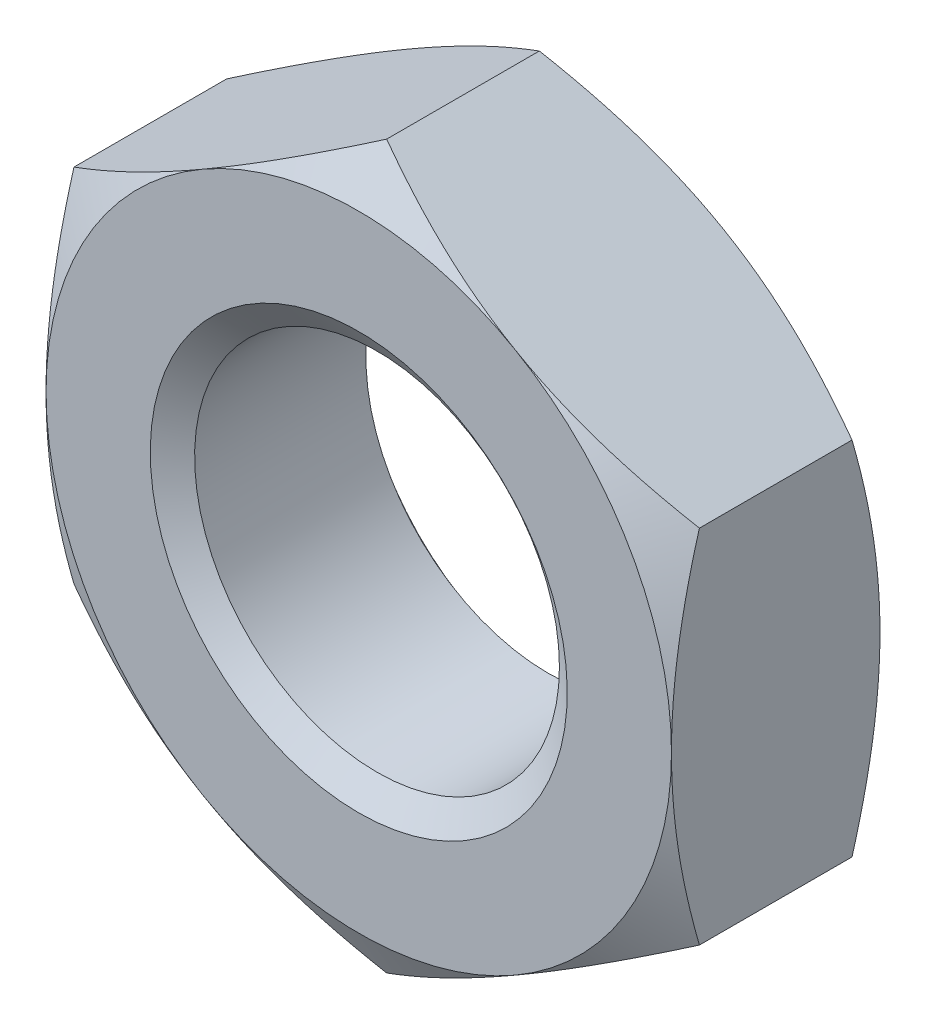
ISO-10303-21;
HEADER;
FILE_DESCRIPTION(('STEP AP214'),'2;1');
FILE_NAME('part.step','',(''),(''),'','','');
FILE_SCHEMA(('AUTOMOTIVE_DESIGN { 1 0 10303 214 1 1 1 1 }'));
ENDSEC;
DATA;
#1=APPLICATION_CONTEXT('core data for automotive mechanical design processes');
#2=APPLICATION_PROTOCOL_DEFINITION('international standard','automotive_design',2000,#1);
#3=PRODUCT_CONTEXT('',#1,'mechanical');
#4=PRODUCT('Part','Part','',(#3));
#5=PRODUCT_RELATED_PRODUCT_CATEGORY('part','',(#4));
#6=PRODUCT_DEFINITION_FORMATION('','',#4);
#7=PRODUCT_DEFINITION_CONTEXT('part definition',#1,'design');
#8=PRODUCT_DEFINITION('design','',#6,#7);
#9=PRODUCT_DEFINITION_SHAPE('','',#8);
#10=(LENGTH_UNIT() NAMED_UNIT(*) SI_UNIT(.MILLI.,.METRE.));
#11=(NAMED_UNIT(*) PLANE_ANGLE_UNIT() SI_UNIT($,.RADIAN.));
#12=(NAMED_UNIT(*) SI_UNIT($,.STERADIAN.) SOLID_ANGLE_UNIT());
#13=UNCERTAINTY_MEASURE_WITH_UNIT(LENGTH_MEASURE(1.E-05),#10,'distance_accuracy_value','');
#14=(GEOMETRIC_REPRESENTATION_CONTEXT(3) GLOBAL_UNCERTAINTY_ASSIGNED_CONTEXT((#13)) GLOBAL_UNIT_ASSIGNED_CONTEXT((#10,
#11,#12)) REPRESENTATION_CONTEXT('',''));
#15=CARTESIAN_POINT('',(0.,0.,0.));
#16=DIRECTION('',(0.,0.,1.));
#17=DIRECTION('',(1.,0.,0.));
#18=AXIS2_PLACEMENT_3D('',#15,#16,#17);
#19=CARTESIAN_POINT('',(-1.83186799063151E-12,13.8564064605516,-7.99999999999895));
#20=DIRECTION('',(0.,0.,-1.));
#21=DIRECTION('',(0.,1.,0.));
#22=AXIS2_PLACEMENT_3D('',#19,#20,#21);
#23=PLANE('',#22);
#24=CARTESIAN_POINT('',(-1.69011516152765E-12,4.88540473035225E-13,-7.99999999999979));
#25=DIRECTION('',(0.,0.,1.));
#26=DIRECTION('',(0.,-1.,0.));
#27=AXIS2_PLACEMENT_3D('',#24,#25,#26);
#28=CIRCLE('',#27,8.00000000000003);
#29=CARTESIAN_POINT('',(-1.69011516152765E-12,-7.99999999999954,-7.99999999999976));
#30=VERTEX_POINT('',#29);
#31=EDGE_CURVE('E18',#30,#30,#28,.T.);
#32=ORIENTED_EDGE('',*,*,#31,.T.);
#33=EDGE_LOOP('',(#32));
#34=FACE_BOUND('',#33,.T.);
#35=CARTESIAN_POINT('',(0.,0.,-8.00000000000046));
#36=DIRECTION('',(0.,0.,1.));
#37=DIRECTION('',(0.,-1.,0.));
#38=AXIS2_PLACEMENT_3D('',#35,#36,#37);
#39=CIRCLE('',#38,11.9999999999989);
#40=CARTESIAN_POINT('',(5.99999999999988,-10.3923048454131,-8.00000000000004));
#41=VERTEX_POINT('',#40);
#42=CARTESIAN_POINT('',(11.9999999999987,0.,-8.00000000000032));
#43=VERTEX_POINT('',#42);
#44=EDGE_CURVE('E101',#41,#43,#39,.T.);
#45=ORIENTED_EDGE('',*,*,#44,.F.);
#46=CARTESIAN_POINT('',(0.,0.,-7.9999999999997));
#47=DIRECTION('',(0.,0.,1.));
#48=DIRECTION('',(0.,-1.,0.));
#49=AXIS2_PLACEMENT_3D('',#46,#47,#48);
#50=CIRCLE('',#49,12.0000000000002);
#51=CARTESIAN_POINT('',(-6.00000000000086,-10.3923048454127,-7.99999999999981));
#52=VERTEX_POINT('',#51);
#53=EDGE_CURVE('E110',#52,#41,#50,.T.);
#54=ORIENTED_EDGE('',*,*,#53,.F.);
#55=CARTESIAN_POINT('',(0.,0.,-7.99999999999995));
#56=DIRECTION('',(0.,0.,1.));
#57=DIRECTION('',(0.,-1.,0.));
#58=AXIS2_PLACEMENT_3D('',#55,#56,#57);
#59=CIRCLE('',#58,11.9999999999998);
#60=CARTESIAN_POINT('',(-12.0000000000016,0.,-7.99999999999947));
#61=VERTEX_POINT('',#60);
#62=EDGE_CURVE('E418',#61,#52,#59,.T.);
#63=ORIENTED_EDGE('',*,*,#62,.F.);
#64=CARTESIAN_POINT('',(0.,0.,-7.99999999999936));
#65=DIRECTION('',(0.,0.,1.));
#66=DIRECTION('',(0.,-1.,0.));
#67=AXIS2_PLACEMENT_3D('',#64,#65,#66);
#68=CIRCLE('',#67,12.0000000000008);
#69=CARTESIAN_POINT('',(-6.00000000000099,10.3923048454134,-7.99999999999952));
#70=VERTEX_POINT('',#69);
#71=EDGE_CURVE('E166',#70,#61,#68,.T.);
#72=ORIENTED_EDGE('',*,*,#71,.F.);
#73=CARTESIAN_POINT('',(0.,0.,-7.99999999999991));
#74=DIRECTION('',(0.,0.,1.));
#75=DIRECTION('',(0.,-1.,0.));
#76=AXIS2_PLACEMENT_3D('',#73,#74,#75);
#77=CIRCLE('',#76,11.9999999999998);
#78=CARTESIAN_POINT('',(5.99999999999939,10.3923048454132,-8.00000000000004));
#79=VERTEX_POINT('',#78);
#80=EDGE_CURVE('E116',#79,#70,#77,.T.);
#81=ORIENTED_EDGE('',*,*,#80,.F.);
#82=CARTESIAN_POINT('',(0.,0.,-8.00000000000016));
#83=DIRECTION('',(0.,0.,1.));
#84=DIRECTION('',(0.,-1.,0.));
#85=AXIS2_PLACEMENT_3D('',#82,#83,#84);
#86=CIRCLE('',#85,11.9999999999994);
#87=EDGE_CURVE('E111',#43,#79,#86,.T.);
#88=ORIENTED_EDGE('',*,*,#87,.F.);
#89=EDGE_LOOP('',(#45,#54,#63,#72,#81,#88));
#90=FACE_BOUND('',#89,.T.);
#91=ADVANCED_FACE('F15',(#34,#90),#23,.T.);
#92=CARTESIAN_POINT('',(-1.65145674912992E-12,4.44089209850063E-13,-25.037505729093));
#93=DIRECTION('',(0.,0.,1.));
#94=DIRECTION('',(0.,-1.,0.));
#95=AXIS2_PLACEMENT_3D('',#92,#93,#94);
#96=CYLINDRICAL_SURFACE('',#95,8.00000000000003);
#97=ORIENTED_EDGE('',*,*,#31,.F.);
#98=EDGE_LOOP('',(#97));
#99=FACE_BOUND('',#98,.T.);
#100=CARTESIAN_POINT('',(-9.85322934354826E-13,1.38777878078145E-12,-7.97460000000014));
#101=DIRECTION('',(0.,0.,-1.));
#102=DIRECTION('',(-1.,0.,0.));
#103=AXIS2_PLACEMENT_3D('',#100,#101,#102);
#104=CIRCLE('',#103,8.00000000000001);
#105=CARTESIAN_POINT('',(-8.00000000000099,1.37670430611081E-12,-7.97460000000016));
#106=VERTEX_POINT('',#105);
#107=EDGE_CURVE('E165',#106,#106,#104,.F.);
#108=ORIENTED_EDGE('',*,*,#107,.T.);
#109=EDGE_LOOP('',(#108));
#110=FACE_BOUND('',#109,.T.);
#111=ADVANCED_FACE('F157',(#99,#110),#96,.F.);
#112=CARTESIAN_POINT('',(0.,0.,-6.92177244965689));
#113=DIRECTION('',(0.,0.,1.));
#114=DIRECTION('',(0.,-1.,0.));
#115=AXIS2_PLACEMENT_3D('',#112,#113,#114);
#116=CONICAL_SURFACE('',#115,13.8675448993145,1.0471975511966);
#117=CARTESIAN_POINT('',(11.9999999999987,6.92820323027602,-6.92820323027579));
#118=CARTESIAN_POINT('',(11.9999999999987,6.36399154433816,-7.091059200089));
#119=CARTESIAN_POINT('',(11.9999999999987,5.79563880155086,-7.24024473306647));
#120=CARTESIAN_POINT('',(11.9999999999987,4.93861967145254,-7.43772504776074));
#121=CARTESIAN_POINT('',(11.9999999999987,4.65290698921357,-7.49904993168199));
#122=CARTESIAN_POINT('',(11.9999999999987,4.07960857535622,-7.61222368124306));
#123=CARTESIAN_POINT('',(11.9999999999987,3.79202295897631,-7.6640731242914));
#124=CARTESIAN_POINT('',(11.9999999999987,3.21482083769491,-7.75746975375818));
#125=CARTESIAN_POINT('',(11.9999999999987,2.92520230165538,-7.79900443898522));
#126=CARTESIAN_POINT('',(11.9999999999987,2.34458000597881,-7.87089898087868));
#127=CARTESIAN_POINT('',(11.9999999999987,2.05357628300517,-7.90125913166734));
#128=CARTESIAN_POINT('',(11.9999999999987,1.46910561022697,-7.95027570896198));
#129=CARTESIAN_POINT('',(11.9999999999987,1.17563362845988,-7.96887261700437));
#130=CARTESIAN_POINT('',(11.9999999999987,0.588112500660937,-7.99376065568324));
#131=CARTESIAN_POINT('',(11.9999999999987,0.294063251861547,-8.00004934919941));
#132=CARTESIAN_POINT('',(11.9999999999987,0.,-8.0000000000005));
#133=B_SPLINE_CURVE_WITH_KNOTS('',3,(#117,#118,#119,#120,#121,#122,#123,#124,#125,#126,#127,
#128,#129,#130,#131,#132),.UNSPECIFIED.,.F.,.F.,(4,2,2,2,2,2,2,4),(0.,1.76168798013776,
2.63822760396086,3.51471379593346,4.39225713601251,5.2697773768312,6.15170281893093,
7.0338028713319),.UNSPECIFIED.);
#134=CARTESIAN_POINT('',(11.9999999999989,6.9282032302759,-6.92820323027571));
#135=VERTEX_POINT('',#134);
#136=EDGE_CURVE('E125',#135,#43,#133,.T.);
#137=ORIENTED_EDGE('',*,*,#136,.T.);
#138=ORIENTED_EDGE('',*,*,#87,.T.);
#139=CARTESIAN_POINT('',(11.9999999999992,6.92820323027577,-6.92820323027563));
#140=CARTESIAN_POINT('',(11.511378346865,7.21030907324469,-7.0910592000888));
#141=CARTESIAN_POINT('',(11.0191704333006,7.49448544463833,-7.24024473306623));
#142=CARTESIAN_POINT('',(10.2769700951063,7.92299500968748,-7.43772504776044));
#143=CARTESIAN_POINT('',(10.0295356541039,8.06585135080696,-7.49904993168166));
#144=CARTESIAN_POINT('',(9.53304466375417,8.35250055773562,-7.61222368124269));
#145=CARTESIAN_POINT('',(9.28398821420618,8.49629336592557,-7.66407312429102));
#146=CARTESIAN_POINT('',(8.78411651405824,8.78489442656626,-7.75746975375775));
#147=CARTESIAN_POINT('',(8.53329950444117,8.92970369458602,-7.79900443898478));
#148=CARTESIAN_POINT('',(8.03046584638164,9.22001484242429,-7.8708989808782));
#149=CARTESIAN_POINT('',(7.77844922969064,9.3655167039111,-7.90125913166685));
#150=CARTESIAN_POINT('',(7.27228277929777,9.65775204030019,-7.95027570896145));
#151=CARTESIAN_POINT('',(7.01812858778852,9.80448803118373,-7.96887261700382));
#152=CARTESIAN_POINT('',(6.50932036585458,10.0982485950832,-7.99376065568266));
#153=CARTESIAN_POINT('',(6.25466624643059,10.2452732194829,-8.00004934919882));
#154=CARTESIAN_POINT('',(5.99999999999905,10.3923048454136,-7.9999999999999));
#155=B_SPLINE_CURVE_WITH_KNOTS('',3,(#139,#140,#141,#142,#143,#144,#145,#146,#147,#148,#149,
#150,#151,#152,#153,#154),.UNSPECIFIED.,.F.,.F.,(4,2,2,2,2,2,2,4),(0.,1.76168798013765,
2.6382276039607,3.51471379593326,4.39225713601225,5.26977737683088,6.15170281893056,
7.03380287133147),.UNSPECIFIED.);
#156=EDGE_CURVE('E131',#135,#79,#155,.T.);
#157=ORIENTED_EDGE('',*,*,#156,.F.);
#158=EDGE_LOOP('',(#137,#138,#157));
#159=FACE_BOUND('',#158,.T.);
#160=ADVANCED_FACE('F130',(#159),#116,.T.);
#161=CARTESIAN_POINT('',(0.,0.,-6.92177244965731));
#162=DIRECTION('',(0.,0.,1.));
#163=DIRECTION('',(0.,-1.,0.));
#164=AXIS2_PLACEMENT_3D('',#161,#162,#163);
#165=CONICAL_SURFACE('',#164,13.8675448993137,1.0471975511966);
#166=ORIENTED_EDGE('',*,*,#44,.T.);
#167=CARTESIAN_POINT('',(11.9999999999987,0.,-8.0000000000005));
#168=CARTESIAN_POINT('',(11.9999999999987,-0.294063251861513,-8.00004934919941));
#169=CARTESIAN_POINT('',(11.9999999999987,-0.588112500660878,-7.99376065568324));
#170=CARTESIAN_POINT('',(11.9999999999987,-1.17563362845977,-7.96887261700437));
#171=CARTESIAN_POINT('',(11.9999999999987,-1.46910561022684,-7.95027570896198));
#172=CARTESIAN_POINT('',(11.9999999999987,-2.05357628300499,-7.90125913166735));
#173=CARTESIAN_POINT('',(11.9999999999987,-2.34458000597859,-7.87089898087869));
#174=CARTESIAN_POINT('',(11.9999999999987,-2.92520230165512,-7.79900443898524));
#175=CARTESIAN_POINT('',(11.9999999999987,-3.21482083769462,-7.7574697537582));
#176=CARTESIAN_POINT('',(11.9999999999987,-3.79202295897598,-7.66407312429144));
#177=CARTESIAN_POINT('',(11.9999999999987,-4.07960857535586,-7.61222368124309));
#178=CARTESIAN_POINT('',(11.9999999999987,-4.65290698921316,-7.49904993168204));
#179=CARTESIAN_POINT('',(11.9999999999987,-4.9386196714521,-7.4377250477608));
#180=CARTESIAN_POINT('',(11.9999999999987,-5.79563880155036,-7.24024473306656));
#181=CARTESIAN_POINT('',(11.9999999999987,-6.36399154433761,-7.09105920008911));
#182=CARTESIAN_POINT('',(11.9999999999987,-6.92820323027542,-6.92820323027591));
#183=B_SPLINE_CURVE_WITH_KNOTS('',3,(#167,#168,#169,#170,#171,#172,#173,#174,#175,#176,#177,
#178,#179,#180,#181,#182),.UNSPECIFIED.,.F.,.F.,(4,2,2,2,2,2,2,4),(0.,0.882100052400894,
1.76402549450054,2.64154573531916,3.51908907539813,4.39557526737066,5.27211489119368,
7.03380287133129),.UNSPECIFIED.);
#184=CARTESIAN_POINT('',(11.9999999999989,-6.9282032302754,-6.92820323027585));
#185=VERTEX_POINT('',#184);
#186=EDGE_CURVE('E105',#43,#185,#183,.T.);
#187=ORIENTED_EDGE('',*,*,#186,.T.);
#188=CARTESIAN_POINT('',(5.99999999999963,-10.3923048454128,-8.00000000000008));
#189=CARTESIAN_POINT('',(6.25466624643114,-10.2452732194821,-8.00004934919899));
#190=CARTESIAN_POINT('',(6.50932036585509,-10.0982485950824,-7.99376065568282));
#191=CARTESIAN_POINT('',(7.01812858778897,-9.804488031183,-7.96887261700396));
#192=CARTESIAN_POINT('',(7.27228277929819,-9.65775204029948,-7.95027570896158));
#193=CARTESIAN_POINT('',(7.778449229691,-9.36551670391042,-7.90125913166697));
#194=CARTESIAN_POINT('',(8.03046584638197,-9.22001484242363,-7.87089898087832));
#195=CARTESIAN_POINT('',(8.53329950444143,-8.92970369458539,-7.79900443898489));
#196=CARTESIAN_POINT('',(8.78411651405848,-8.78489442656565,-7.75746975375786));
#197=CARTESIAN_POINT('',(9.28398821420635,-8.49629336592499,-7.66407312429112));
#198=CARTESIAN_POINT('',(9.53304466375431,-8.35250055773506,-7.6122236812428));
#199=CARTESIAN_POINT('',(10.029535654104,-8.06585135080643,-7.49904993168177));
#200=CARTESIAN_POINT('',(10.2769700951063,-7.92299500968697,-7.43772504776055));
#201=CARTESIAN_POINT('',(11.0191704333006,-7.49448544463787,-7.24024473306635));
#202=CARTESIAN_POINT('',(11.5113783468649,-7.21030907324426,-7.09105920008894));
#203=CARTESIAN_POINT('',(11.999999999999,-6.92820323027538,-6.92820323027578));
#204=B_SPLINE_CURVE_WITH_KNOTS('',3,(#188,#189,#190,#191,#192,#193,#194,#195,#196,#197,#198,
#199,#200,#201,#202,#203),.UNSPECIFIED.,.F.,.F.,(4,2,2,2,2,2,2,4),(0.,0.882100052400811,
1.76402549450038,2.64154573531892,3.5190890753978,4.39557526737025,5.27211489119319,
7.03380287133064),.UNSPECIFIED.);
#205=EDGE_CURVE('E107',#41,#185,#204,.T.);
#206=ORIENTED_EDGE('',*,*,#205,.F.);
#207=EDGE_LOOP('',(#166,#187,#206));
#208=FACE_BOUND('',#207,.T.);
#209=ADVANCED_FACE('F103',(#208),#165,.T.);
#210=CARTESIAN_POINT('',(0.,0.,-6.92177244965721));
#211=DIRECTION('',(0.,0.,1.));
#212=DIRECTION('',(0.,-1.,0.));
#213=AXIS2_PLACEMENT_3D('',#210,#211,#212);
#214=CONICAL_SURFACE('',#213,13.8675448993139,1.0471975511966);
#215=CARTESIAN_POINT('',(-6.00000000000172,-10.3923048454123,-7.9999999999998));
#216=CARTESIAN_POINT('',(-5.74533375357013,-10.5393364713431,-8.00004934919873));
#217=CARTESIAN_POINT('',(-5.4906796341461,-10.6863610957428,-7.99376065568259));
#218=CARTESIAN_POINT('',(-4.98187141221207,-10.9801216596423,-7.96887261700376));
#219=CARTESIAN_POINT('',(-4.72771722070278,-11.1268576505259,-7.9502757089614));
#220=CARTESIAN_POINT('',(-4.22155077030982,-11.419092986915,-7.9012591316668));
#221=CARTESIAN_POINT('',(-3.96953415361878,-11.5645948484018,-7.87089898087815));
#222=CARTESIAN_POINT('',(-3.46670049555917,-11.8549059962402,-7.79900443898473));
#223=CARTESIAN_POINT('',(-3.21588348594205,-11.99971526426,-7.7574697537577));
#224=CARTESIAN_POINT('',(-2.71601178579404,-12.2883163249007,-7.66407312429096));
#225=CARTESIAN_POINT('',(-2.466955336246,-12.4321091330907,-7.61222368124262));
#226=CARTESIAN_POINT('',(-1.97046434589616,-12.7187583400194,-7.49904993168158));
#227=CARTESIAN_POINT('',(-1.72302990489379,-12.8616146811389,-7.43772504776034));
#228=CARTESIAN_POINT('',(-0.980829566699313,-13.2901242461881,-7.2402447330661));
#229=CARTESIAN_POINT('',(-0.488621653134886,-13.5743006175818,-7.09105920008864));
#230=CARTESIAN_POINT('',(-5.99146304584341E-13,-13.8564064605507,-6.92820323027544));
#231=B_SPLINE_CURVE_WITH_KNOTS('',3,(#215,#216,#217,#218,#219,#220,#221,#222,#223,#224,#225,
#226,#227,#228,#229,#230),.UNSPECIFIED.,.F.,.F.,(4,2,2,2,2,2,2,4),(0.,0.882100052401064,
1.76402549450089,2.64154573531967,3.5190890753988,4.3955752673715,5.27211489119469,
7.03380287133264),.UNSPECIFIED.);
#232=CARTESIAN_POINT('',(-5.31723913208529E-13,-13.8564064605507,-6.92820323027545));
#233=VERTEX_POINT('',#232);
#234=EDGE_CURVE('E275',#52,#233,#231,.T.);
#235=ORIENTED_EDGE('',*,*,#234,.F.);
#236=ORIENTED_EDGE('',*,*,#53,.T.);
#237=CARTESIAN_POINT('',(-4.65131247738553E-13,-13.8564064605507,-6.92820323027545));
#238=CARTESIAN_POINT('',(0.488621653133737,-13.5743006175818,-7.09105920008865));
#239=CARTESIAN_POINT('',(0.980829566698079,-13.2901242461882,-7.2402447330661));
#240=CARTESIAN_POINT('',(1.72302990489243,-12.861614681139,-7.43772504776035));
#241=CARTESIAN_POINT('',(1.97046434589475,-12.7187583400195,-7.49904993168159));
#242=CARTESIAN_POINT('',(2.46695533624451,-12.4321091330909,-7.61222368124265));
#243=CARTESIAN_POINT('',(2.7160117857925,-12.2883163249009,-7.66407312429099));
#244=CARTESIAN_POINT('',(3.21588348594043,-11.9997152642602,-7.75746975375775));
#245=CARTESIAN_POINT('',(3.46670049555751,-11.8549059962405,-7.7990044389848));
#246=CARTESIAN_POINT('',(3.96953415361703,-11.5645948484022,-7.87089898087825));
#247=CARTESIAN_POINT('',(4.22155077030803,-11.4190929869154,-7.90125913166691));
#248=CARTESIAN_POINT('',(4.72771722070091,-11.1268576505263,-7.95027570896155));
#249=CARTESIAN_POINT('',(4.98187141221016,-10.9801216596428,-7.96887261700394));
#250=CARTESIAN_POINT('',(5.4906796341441,-10.6863610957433,-7.99376065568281));
#251=CARTESIAN_POINT('',(5.74533375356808,-10.5393364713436,-8.00004934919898));
#252=CARTESIAN_POINT('',(5.99999999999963,-10.3923048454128,-8.00000000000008));
#253=B_SPLINE_CURVE_WITH_KNOTS('',3,(#237,#238,#239,#240,#241,#242,#243,#244,#245,#246,#247,
#248,#249,#250,#251,#252),.UNSPECIFIED.,.F.,.F.,(4,2,2,2,2,2,2,4),(0.,1.76168798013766,
2.63822760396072,3.51471379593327,4.39225713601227,5.26977737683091,6.15170281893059,
7.03380287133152),.UNSPECIFIED.);
#254=EDGE_CURVE('E295',#233,#41,#253,.T.);
#255=ORIENTED_EDGE('',*,*,#254,.F.);
#256=EDGE_LOOP('',(#235,#236,#255));
#257=FACE_BOUND('',#256,.T.);
#258=ADVANCED_FACE('F288',(#257),#214,.T.);
#259=CARTESIAN_POINT('',(0.,0.,-6.92177244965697));
#260=DIRECTION('',(0.,0.,1.));
#261=DIRECTION('',(0.,-1.,0.));
#262=AXIS2_PLACEMENT_3D('',#259,#260,#261);
#263=CONICAL_SURFACE('',#262,13.8675448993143,1.0471975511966);
#264=CARTESIAN_POINT('',(-12.0000000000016,0.,-7.99999999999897));
#265=CARTESIAN_POINT('',(-12.0000000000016,-0.294063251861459,-8.00004934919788));
#266=CARTESIAN_POINT('',(-12.0000000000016,-0.588112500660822,-7.99376065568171));
#267=CARTESIAN_POINT('',(-12.0000000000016,-1.17563362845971,-7.96887261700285));
#268=CARTESIAN_POINT('',(-12.0000000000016,-1.46910561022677,-7.95027570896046));
#269=CARTESIAN_POINT('',(-12.0000000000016,-2.05357628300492,-7.90125913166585));
#270=CARTESIAN_POINT('',(-12.0000000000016,-2.34458000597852,-7.87089898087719));
#271=CARTESIAN_POINT('',(-12.0000000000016,-2.92520230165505,-7.79900443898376));
#272=CARTESIAN_POINT('',(-12.0000000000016,-3.21482083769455,-7.75746975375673));
#273=CARTESIAN_POINT('',(-12.0000000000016,-3.7920229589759,-7.66407312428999));
#274=CARTESIAN_POINT('',(-12.0000000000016,-4.07960857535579,-7.61222368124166));
#275=CARTESIAN_POINT('',(-12.0000000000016,-4.65290698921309,-7.49904993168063));
#276=CARTESIAN_POINT('',(-12.0000000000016,-4.93861967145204,-7.4377250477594));
#277=CARTESIAN_POINT('',(-12.0000000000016,-5.79563880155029,-7.2402447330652));
#278=CARTESIAN_POINT('',(-12.0000000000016,-6.36399154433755,-7.09105920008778));
#279=CARTESIAN_POINT('',(-12.0000000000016,-6.92820323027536,-6.92820323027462));
#280=B_SPLINE_CURVE_WITH_KNOTS('',3,(#264,#265,#266,#267,#268,#269,#270,#271,#272,#273,#274,
#275,#276,#277,#278,#279),.UNSPECIFIED.,.F.,.F.,(4,2,2,2,2,2,2,4),(0.,0.882100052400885,
1.76402549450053,2.64154573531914,3.5190890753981,4.39557526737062,5.27211489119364,
7.03380287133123),.UNSPECIFIED.);
#281=CARTESIAN_POINT('',(-12.000000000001,-6.92820323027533,-6.92820323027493));
#282=VERTEX_POINT('',#281);
#283=EDGE_CURVE('E270',#61,#282,#280,.T.);
#284=ORIENTED_EDGE('',*,*,#283,.F.);
#285=ORIENTED_EDGE('',*,*,#62,.T.);
#286=CARTESIAN_POINT('',(-12.0000000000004,-6.92820323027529,-6.92820323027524));
#287=CARTESIAN_POINT('',(-11.5113783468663,-7.21030907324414,-7.09105920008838));
#288=CARTESIAN_POINT('',(-11.0191704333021,-7.49448544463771,-7.2402447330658));
#289=CARTESIAN_POINT('',(-10.2769700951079,-7.92299500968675,-7.43772504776));
#290=CARTESIAN_POINT('',(-10.0295356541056,-8.0658513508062,-7.49904993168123));
#291=CARTESIAN_POINT('',(-9.53304466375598,-8.35250055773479,-7.61222368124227));
#292=CARTESIAN_POINT('',(-9.28398821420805,-8.4962933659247,-7.6640731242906));
#293=CARTESIAN_POINT('',(-8.78411651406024,-8.78489442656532,-7.75746975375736));
#294=CARTESIAN_POINT('',(-8.53329950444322,-8.92970369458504,-7.7990044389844));
#295=CARTESIAN_POINT('',(-8.03046584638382,-9.22001484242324,-7.87089898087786));
#296=CARTESIAN_POINT('',(-7.77844922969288,-9.36551670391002,-7.90125913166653));
#297=CARTESIAN_POINT('',(-7.27228277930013,-9.65775204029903,-7.95027570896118));
#298=CARTESIAN_POINT('',(-7.01812858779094,-9.80448803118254,-7.96887261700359));
#299=CARTESIAN_POINT('',(-6.50932036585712,-10.0982485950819,-7.99376065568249));
#300=CARTESIAN_POINT('',(-6.2546662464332,-10.2452732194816,-8.00004934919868));
#301=CARTESIAN_POINT('',(-6.00000000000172,-10.3923048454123,-7.9999999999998));
#302=B_SPLINE_CURVE_WITH_KNOTS('',3,(#286,#287,#288,#289,#290,#291,#292,#293,#294,#295,#296,
#297,#298,#299,#300,#301),.UNSPECIFIED.,.F.,.F.,(4,2,2,2,2,2,2,4),(0.,1.76168798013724,
2.63822760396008,3.51471379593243,4.39225713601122,5.26977737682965,6.15170281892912,
7.03380287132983),.UNSPECIFIED.);
#303=EDGE_CURVE('E281',#282,#52,#302,.T.);
#304=ORIENTED_EDGE('',*,*,#303,.F.);
#305=EDGE_LOOP('',(#284,#285,#304));
#306=FACE_BOUND('',#305,.T.);
#307=ADVANCED_FACE('F291',(#306),#263,.T.);
#308=CARTESIAN_POINT('',(0.,0.,-6.92177244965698));
#309=DIRECTION('',(0.,0.,1.));
#310=DIRECTION('',(0.,-1.,0.));
#311=AXIS2_PLACEMENT_3D('',#308,#309,#310);
#312=CONICAL_SURFACE('',#311,13.8675448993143,1.0471975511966);
#313=CARTESIAN_POINT('',(5.99999999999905,10.3923048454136,-7.9999999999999));
#314=CARTESIAN_POINT('',(5.74533375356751,10.5393364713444,-8.00004934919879));
#315=CARTESIAN_POINT('',(5.49067963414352,10.6863610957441,-7.99376065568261));
#316=CARTESIAN_POINT('',(4.98187141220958,10.9801216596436,-7.96887261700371));
#317=CARTESIAN_POINT('',(4.72771722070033,11.1268576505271,-7.95027570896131));
#318=CARTESIAN_POINT('',(4.22155077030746,11.4190929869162,-7.90125913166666));
#319=CARTESIAN_POINT('',(3.96953415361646,11.564594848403,-7.87089898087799));
#320=CARTESIAN_POINT('',(3.46670049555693,11.8549059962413,-7.79900443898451));
#321=CARTESIAN_POINT('',(3.21588348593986,11.999715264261,-7.75746975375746));
#322=CARTESIAN_POINT('',(2.71601178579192,12.2883163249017,-7.66407312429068));
#323=CARTESIAN_POINT('',(2.46695533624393,12.4321091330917,-7.61222368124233));
#324=CARTESIAN_POINT('',(1.97046434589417,12.7187583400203,-7.49904993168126));
#325=CARTESIAN_POINT('',(1.72302990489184,12.8616146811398,-7.43772504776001));
#326=CARTESIAN_POINT('',(0.9808295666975,13.290124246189,-7.24024473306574));
#327=CARTESIAN_POINT('',(0.48862165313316,13.5743006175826,-7.09105920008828));
#328=CARTESIAN_POINT('',(-1.04622430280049E-12,13.8564064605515,-6.92820323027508));
#329=B_SPLINE_CURVE_WITH_KNOTS('',3,(#313,#314,#315,#316,#317,#318,#319,#320,#321,#322,#323,
#324,#325,#326,#327,#328),.UNSPECIFIED.,.F.,.F.,(4,2,2,2,2,2,2,4),(0.,0.882100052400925,
1.76402549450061,2.64154573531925,3.51908907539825,4.39557526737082,5.27211489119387,
7.03380287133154),.UNSPECIFIED.);
#330=CARTESIAN_POINT('',(-8.54944407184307E-13,13.8564064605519,-6.92820323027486));
#331=VERTEX_POINT('',#330);
#332=EDGE_CURVE('E134',#79,#331,#329,.T.);
#333=ORIENTED_EDGE('',*,*,#332,.F.);
#334=ORIENTED_EDGE('',*,*,#80,.T.);
#335=CARTESIAN_POINT('',(-1.40108550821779E-12,13.8564064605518,-6.92820323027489));
#336=CARTESIAN_POINT('',(-0.488621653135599,13.5743006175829,-7.09105920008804));
#337=CARTESIAN_POINT('',(-0.980829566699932,13.2901242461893,-7.24024473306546));
#338=CARTESIAN_POINT('',(-1.72302990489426,12.8616146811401,-7.43772504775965));
#339=CARTESIAN_POINT('',(-1.97046434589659,12.7187583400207,-7.49904993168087));
#340=CARTESIAN_POINT('',(-2.46695533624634,12.432109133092,-7.61222368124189));
#341=CARTESIAN_POINT('',(-2.71601178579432,12.2883163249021,-7.66407312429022));
#342=CARTESIAN_POINT('',(-3.21588348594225,11.9997152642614,-7.75746975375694));
#343=CARTESIAN_POINT('',(-3.46670049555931,11.8549059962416,-7.79900443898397));
#344=CARTESIAN_POINT('',(-3.96953415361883,11.5645948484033,-7.87089898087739));
#345=CARTESIAN_POINT('',(-4.22155077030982,11.4190929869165,-7.90125913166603));
#346=CARTESIAN_POINT('',(-4.72771722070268,11.1268576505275,-7.95027570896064));
#347=CARTESIAN_POINT('',(-4.98187141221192,10.9801216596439,-7.96887261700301));
#348=CARTESIAN_POINT('',(-5.49067963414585,10.6863610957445,-7.99376065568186));
#349=CARTESIAN_POINT('',(-5.74533375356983,10.5393364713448,-8.00004934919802));
#350=CARTESIAN_POINT('',(-6.00000000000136,10.392304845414,-7.9999999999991));
#351=B_SPLINE_CURVE_WITH_KNOTS('',3,(#335,#336,#337,#338,#339,#340,#341,#342,#343,#344,#345,
#346,#347,#348,#349,#350),.UNSPECIFIED.,.F.,.F.,(4,2,2,2,2,2,2,4),(0.,1.76168798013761,
2.63822760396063,3.51471379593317,4.39225713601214,5.26977737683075,6.15170281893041,
7.0338028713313),.UNSPECIFIED.);
#352=EDGE_CURVE('E250',#331,#70,#351,.T.);
#353=ORIENTED_EDGE('',*,*,#352,.F.);
#354=EDGE_LOOP('',(#333,#334,#353));
#355=FACE_BOUND('',#354,.T.);
#356=ADVANCED_FACE('F258',(#355),#312,.T.);
#357=CARTESIAN_POINT('',(0.,0.,-6.92177244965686));
#358=DIRECTION('',(0.,0.,1.));
#359=DIRECTION('',(0.,-1.,0.));
#360=AXIS2_PLACEMENT_3D('',#357,#358,#359);
#361=CONICAL_SURFACE('',#360,13.8675448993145,1.0471975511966);
#362=ORIENTED_EDGE('',*,*,#71,.T.);
#363=CARTESIAN_POINT('',(-12.0000000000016,6.92820323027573,-6.92820323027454));
#364=CARTESIAN_POINT('',(-12.0000000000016,6.3639915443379,-7.09105920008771));
#365=CARTESIAN_POINT('',(-12.0000000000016,5.79563880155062,-7.24024473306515));
#366=CARTESIAN_POINT('',(-12.0000000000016,4.93861967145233,-7.43772504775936));
#367=CARTESIAN_POINT('',(-12.0000000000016,4.65290698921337,-7.49904993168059));
#368=CARTESIAN_POINT('',(-12.0000000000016,4.07960857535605,-7.61222368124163));
#369=CARTESIAN_POINT('',(-12.0000000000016,3.79202295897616,-7.66407312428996));
#370=CARTESIAN_POINT('',(-12.0000000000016,3.21482083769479,-7.75746975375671));
#371=CARTESIAN_POINT('',(-12.0000000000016,2.92520230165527,-7.79900443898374));
#372=CARTESIAN_POINT('',(-12.0000000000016,2.34458000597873,-7.87089898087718));
#373=CARTESIAN_POINT('',(-12.0000000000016,2.05357628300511,-7.90125913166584));
#374=CARTESIAN_POINT('',(-12.0000000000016,1.46910561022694,-7.95027570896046));
#375=CARTESIAN_POINT('',(-12.0000000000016,1.17563362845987,-7.96887261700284));
#376=CARTESIAN_POINT('',(-12.0000000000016,0.588112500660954,-7.99376065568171));
#377=CARTESIAN_POINT('',(-12.0000000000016,0.294063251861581,-8.00004934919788));
#378=CARTESIAN_POINT('',(-12.0000000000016,0.,-7.99999999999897));
#379=B_SPLINE_CURVE_WITH_KNOTS('',3,(#363,#364,#365,#366,#367,#368,#369,#370,#371,#372,#373,
#374,#375,#376,#377,#378),.UNSPECIFIED.,.F.,.F.,(4,2,2,2,2,2,2,4),(0.,1.76168798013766,
2.63822760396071,3.51471379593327,4.39225713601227,5.26977737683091,6.15170281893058,
7.0338028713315),.UNSPECIFIED.);
#380=CARTESIAN_POINT('',(-12.0000000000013,6.92820323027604,-6.92820323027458));
#381=VERTEX_POINT('',#380);
#382=EDGE_CURVE('E264',#381,#61,#379,.T.);
#383=ORIENTED_EDGE('',*,*,#382,.F.);
#384=CARTESIAN_POINT('',(-6.00000000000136,10.392304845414,-7.9999999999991));
#385=CARTESIAN_POINT('',(-6.25466624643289,10.2452732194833,-8.000049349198));
#386=CARTESIAN_POINT('',(-6.50932036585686,10.0982485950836,-7.99376065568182));
#387=CARTESIAN_POINT('',(-7.01812858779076,9.80448803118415,-7.96887261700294));
#388=CARTESIAN_POINT('',(-7.27228277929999,9.65775204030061,-7.95027570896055));
#389=CARTESIAN_POINT('',(-7.77844922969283,9.36551670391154,-7.90125913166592));
#390=CARTESIAN_POINT('',(-8.03046584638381,9.22001484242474,-7.87089898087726));
#391=CARTESIAN_POINT('',(-8.53329950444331,8.92970369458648,-7.79900443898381));
#392=CARTESIAN_POINT('',(-8.78411651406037,8.78489442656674,-7.75746975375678));
#393=CARTESIAN_POINT('',(-9.28398821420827,8.49629336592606,-7.66407312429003));
#394=CARTESIAN_POINT('',(-9.53304466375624,8.35250055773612,-7.61222368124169));
#395=CARTESIAN_POINT('',(-10.029535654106,8.06585135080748,-7.49904993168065));
#396=CARTESIAN_POINT('',(-10.2769700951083,7.922995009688,-7.43772504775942));
#397=CARTESIAN_POINT('',(-11.0191704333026,7.49448544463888,-7.24024473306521));
#398=CARTESIAN_POINT('',(-11.5113783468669,7.21030907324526,-7.09105920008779));
#399=CARTESIAN_POINT('',(-12.0000000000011,6.92820323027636,-6.92820323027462));
#400=B_SPLINE_CURVE_WITH_KNOTS('',3,(#384,#385,#386,#387,#388,#389,#390,#391,#392,#393,#394,
#395,#396,#397,#398,#399),.UNSPECIFIED.,.F.,.F.,(4,2,2,2,2,2,2,4),(0.,0.882100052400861,
1.76402549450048,2.64154573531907,3.51908907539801,4.39557526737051,5.2721148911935,
7.03380287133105),.UNSPECIFIED.);
#401=EDGE_CURVE('E244',#70,#381,#400,.T.);
#402=ORIENTED_EDGE('',*,*,#401,.F.);
#403=EDGE_LOOP('',(#362,#383,#402));
#404=FACE_BOUND('',#403,.T.);
#405=ADVANCED_FACE('F255',(#404),#361,.T.);
#406=CARTESIAN_POINT('',(-9.85322934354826E-13,1.38777878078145E-12,-7.97460000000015));
#407=DIRECTION('',(0.,0.,-1.));
#408=DIRECTION('',(0.,1.,0.));
#409=AXIS2_PLACEMENT_3D('',#406,#407,#408);
#410=CONICAL_SURFACE('',#409,8.00000000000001,0.959931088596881);
#411=CARTESIAN_POINT('',(0.,0.,-7.2743924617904));
#412=DIRECTION('',(0.,0.,1.));
#413=DIRECTION('',(0.,-1.,0.));
#414=AXIS2_PLACEMENT_3D('',#411,#412,#413);
#415=CIRCLE('',#414,7.00000000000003);
#416=CARTESIAN_POINT('',(0.,-7.00000000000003,-7.27439246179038));
#417=VERTEX_POINT('',#416);
#418=EDGE_CURVE('E249',#417,#417,#415,.T.);
#419=ORIENTED_EDGE('',*,*,#418,.T.);
#420=EDGE_LOOP('',(#419));
#421=FACE_BOUND('',#420,.T.);
#422=ORIENTED_EDGE('',*,*,#107,.F.);
#423=EDGE_LOOP('',(#422));
#424=FACE_BOUND('',#423,.T.);
#425=ADVANCED_FACE('F172',(#421,#424),#410,.F.);
#426=CARTESIAN_POINT('',(11.9999999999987,6.92820323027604,-7.99999999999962));
#427=DIRECTION('',(0.500000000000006,0.866025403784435,0.));
#428=DIRECTION('',(-0.866025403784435,0.500000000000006,0.));
#429=AXIS2_PLACEMENT_3D('',#426,#427,#428);
#430=PLANE('',#429);
#431=ORIENTED_EDGE('',*,*,#156,.T.);
#432=ORIENTED_EDGE('',*,*,#332,.T.);
#433=DIRECTION('',(0.,0.,1.));
#434=VECTOR('',#433,1.);
#435=CARTESIAN_POINT('',(-6.6389610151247E-13,13.8564064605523,-7.99999999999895));
#436=LINE('',#435,#434);
#437=CARTESIAN_POINT('',(1.15425266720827E-08,13.8564064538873,-1.0717967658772));
#438=VERTEX_POINT('',#437);
#439=EDGE_CURVE('E361',#438,#331,#436,.F.);
#440=ORIENTED_EDGE('',*,*,#439,.F.);
#441=CARTESIAN_POINT('',(5.99999999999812,10.3923048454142,1.0701196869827E-13));
#442=CARTESIAN_POINT('',(5.74533375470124,10.5393364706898,4.93491981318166E-05));
#443=CARTESIAN_POINT('',(5.49067963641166,10.6863610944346,-0.00623934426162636));
#444=CARTESIAN_POINT('',(4.98187141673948,10.9801216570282,-0.0311273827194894));
#445=CARTESIAN_POINT('',(4.7277172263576,11.1268576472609,-0.0497242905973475));
#446=CARTESIAN_POINT('',(4.22155077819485,11.4190929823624,-0.0987408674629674));
#447=CARTESIAN_POINT('',(3.96953416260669,11.5645948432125,-0.129101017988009));
#448=CARTESIAN_POINT('',(3.46670050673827,11.8549059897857,-0.200995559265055));
#449=CARTESIAN_POINT('',(3.21588349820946,11.9997152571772,-0.242530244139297));
#450=CARTESIAN_POINT('',(2.71601180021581,12.2883163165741,-0.335926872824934));
#451=CARTESIAN_POINT('',(2.46695535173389,12.4321091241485,-0.387776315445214));
#452=CARTESIAN_POINT('',(1.97046436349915,12.7187583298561,-0.500950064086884));
#453=CARTESIAN_POINT('',(1.72302992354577,12.8616146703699,-0.562274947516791));
#454=CARTESIAN_POINT('',(0.98082958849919,13.2901242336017,-0.759755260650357));
#455=CARTESIAN_POINT('',(0.48862167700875,13.574300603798,-0.908940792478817));
#456=CARTESIAN_POINT('',(2.59196575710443E-08,13.8564064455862,-1.07179676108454));
#457=B_SPLINE_CURVE_WITH_KNOTS('',3,(#441,#442,#443,#444,#445,#446,#447,#448,#449,#450,#451,
#452,#453,#454,#455,#456),.UNSPECIFIED.,.F.,.F.,(4,2,2,2,2,2,2,4),(0.,0.882100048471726,
1.76402548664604,2.64154572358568,3.51908905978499,4.39557524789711,5.27211486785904,
7.03380284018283),.UNSPECIFIED.);
#458=CARTESIAN_POINT('',(5.9999999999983,10.3923048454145,0.));
#459=VERTEX_POINT('',#458);
#460=EDGE_CURVE('E178',#459,#438,#457,.T.);
#461=ORIENTED_EDGE('',*,*,#460,.F.);
#462=CARTESIAN_POINT('',(12.0000000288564,6.92820321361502,-1.07179677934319));
#463=CARTESIAN_POINT('',(11.5113783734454,7.21030905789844,-0.908940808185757));
#464=CARTESIAN_POINT('',(11.0191704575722,7.4944854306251,-0.75975527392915));
#465=CARTESIAN_POINT('',(10.2769701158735,7.92299499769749,-0.562274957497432));
#466=CARTESIAN_POINT('',(10.0295356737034,8.06585133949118,-0.500950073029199));
#467=CARTESIAN_POINT('',(9.53304468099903,8.35250054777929,-0.387776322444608));
#468=CARTESIAN_POINT('',(9.2839882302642,8.49629335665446,-0.335926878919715));
#469=CARTESIAN_POINT('',(8.78411652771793,8.78489441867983,-0.242530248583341));
#470=CARTESIAN_POINT('',(8.5332995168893,8.92970368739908,-0.200995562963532));
#471=CARTESIAN_POINT('',(8.03046585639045,9.2200148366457,-0.129101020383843));
#472=CARTESIAN_POINT('',(7.77844923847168,9.36551669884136,-0.0987408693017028));
#473=CARTESIAN_POINT('',(7.27228278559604,9.65775203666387,-0.0497242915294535));
#474=CARTESIAN_POINT('',(7.0181285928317,9.80448802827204,-0.0311273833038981));
#475=CARTESIAN_POINT('',(6.50932036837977,10.0982485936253,-0.00623934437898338));
#476=CARTESIAN_POINT('',(6.25466624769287,10.2452732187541,4.93491999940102E-05));
#477=CARTESIAN_POINT('',(5.99999999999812,10.3923048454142,1.07343529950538E-13));
#478=B_SPLINE_CURVE_WITH_KNOTS('',3,(#462,#463,#464,#465,#466,#467,#468,#469,#470,#471,#472,
#473,#474,#475,#476,#477),.UNSPECIFIED.,.F.,.F.,(4,2,2,2,2,2,2,4),(0.,1.76168798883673,
2.63822761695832,3.51471381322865,4.39225715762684,5.26977740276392,6.15170284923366,
7.0338029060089),.UNSPECIFIED.);
#479=CARTESIAN_POINT('',(11.9999999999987,6.92820318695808,-1.07179675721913));
#480=VERTEX_POINT('',#479);
#481=EDGE_CURVE('E187',#480,#459,#478,.T.);
#482=ORIENTED_EDGE('',*,*,#481,.F.);
#483=DIRECTION('',(0.,0.,1.));
#484=VECTOR('',#483,1.);
#485=CARTESIAN_POINT('',(11.9999999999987,6.92820323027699,-7.99999999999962));
#486=LINE('',#485,#484);
#487=EDGE_CURVE('E132',#480,#135,#486,.F.);
#488=ORIENTED_EDGE('',*,*,#487,.T.);
#489=EDGE_LOOP('',(#431,#432,#440,#461,#482,#488));
#490=FACE_BOUND('',#489,.T.);
#491=ADVANCED_FACE('F168',(#490),#430,.T.);
#492=CARTESIAN_POINT('',(11.9999999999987,6.92820323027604,-7.99999999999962));
#493=DIRECTION('',(-1.,0.,0.));
#494=DIRECTION('',(0.,0.,1.));
#495=AXIS2_PLACEMENT_3D('',#492,#493,#494);
#496=PLANE('',#495);
#497=DIRECTION('',(0.,0.,1.));
#498=VECTOR('',#497,1.);
#499=CARTESIAN_POINT('',(11.9999999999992,-6.92820323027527,-7.99999999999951));
#500=LINE('',#499,#498);
#501=CARTESIAN_POINT('',(12.0000000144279,-6.92820322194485,-1.07179677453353));
#502=VERTEX_POINT('',#501);
#503=EDGE_CURVE('E128',#185,#502,#500,.T.);
#504=ORIENTED_EDGE('',*,*,#503,.F.);
#505=ORIENTED_EDGE('',*,*,#186,.F.);
#506=ORIENTED_EDGE('',*,*,#136,.F.);
#507=ORIENTED_EDGE('',*,*,#487,.F.);
#508=CARTESIAN_POINT('',(11.9999999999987,0.,8.17120036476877E-13));
#509=CARTESIAN_POINT('',(11.9999999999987,0.294063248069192,4.93491972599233E-05));
#510=CARTESIAN_POINT('',(11.9999999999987,0.588112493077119,-0.00623934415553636));
#511=CARTESIAN_POINT('',(11.9999999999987,1.17563361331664,-0.0311273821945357));
#512=CARTESIAN_POINT('',(11.9999999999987,1.46910559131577,-0.0497242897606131));
#513=CARTESIAN_POINT('',(11.9999999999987,2.05357625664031,-0.0987408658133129));
#514=CARTESIAN_POINT('',(11.9999999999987,2.34457997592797,-0.129101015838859));
#515=CARTESIAN_POINT('',(11.9999999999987,2.92520226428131,-0.200995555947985));
#516=CARTESIAN_POINT('',(11.9999999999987,3.21482079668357,-0.242530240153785));
#517=CARTESIAN_POINT('',(11.9999999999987,3.79202291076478,-0.33592686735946));
#518=CARTESIAN_POINT('',(11.9999999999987,4.07960852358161,-0.387776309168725));
#519=CARTESIAN_POINT('',(11.9999999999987,4.65290693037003,-0.500950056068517));
#520=CARTESIAN_POINT('',(11.9999999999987,4.93861960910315,-0.562274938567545));
#521=CARTESIAN_POINT('',(11.9999999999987,5.79563872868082,-0.75975524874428));
#522=CARTESIAN_POINT('',(11.9999999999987,6.36399146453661,-0.908940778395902));
#523=CARTESIAN_POINT('',(11.9999999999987,6.92820314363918,-1.07179674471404));
#524=B_SPLINE_CURVE_WITH_KNOTS('',3,(#508,#509,#510,#511,#512,#513,#514,#515,#516,#517,#518,
#519,#520,#521,#522,#523),.UNSPECIFIED.,.F.,.F.,(4,2,2,2,2,2,2,4),(0.,0.882100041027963,
1.76402547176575,2.64154570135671,3.51908903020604,4.39557521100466,5.27211482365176,
7.03380278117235),.UNSPECIFIED.);
#525=CARTESIAN_POINT('',(11.9999999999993,0.,4.74798217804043E-13));
#526=VERTEX_POINT('',#525);
#527=EDGE_CURVE('E195',#526,#480,#524,.T.);
#528=ORIENTED_EDGE('',*,*,#527,.F.);
#529=CARTESIAN_POINT('',(11.9999999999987,-6.92820314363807,-1.07179674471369));
#530=CARTESIAN_POINT('',(11.9999999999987,-6.36399146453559,-0.9089407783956));
#531=CARTESIAN_POINT('',(11.9999999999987,-5.79563872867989,-0.759755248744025));
#532=CARTESIAN_POINT('',(11.9999999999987,-4.93861960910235,-0.562274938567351));
#533=CARTESIAN_POINT('',(11.9999999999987,-4.65290693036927,-0.500950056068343));
#534=CARTESIAN_POINT('',(11.9999999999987,-4.07960852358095,-0.387776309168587));
#535=CARTESIAN_POINT('',(11.9999999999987,-3.79202291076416,-0.335926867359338));
#536=CARTESIAN_POINT('',(11.9999999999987,-3.21482079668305,-0.242530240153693));
#537=CARTESIAN_POINT('',(11.9999999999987,-2.92520226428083,-0.200995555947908));
#538=CARTESIAN_POINT('',(11.9999999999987,-2.34457997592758,-0.129101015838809));
#539=CARTESIAN_POINT('',(11.9999999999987,-2.05357625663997,-0.0987408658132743));
#540=CARTESIAN_POINT('',(11.9999999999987,-1.46910559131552,-0.0497242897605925));
#541=CARTESIAN_POINT('',(11.9999999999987,-1.17563361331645,-0.0311273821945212));
#542=CARTESIAN_POINT('',(11.9999999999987,-0.588112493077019,-0.00623934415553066));
#543=CARTESIAN_POINT('',(11.9999999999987,-0.29406324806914,4.93491972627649E-05));
#544=CARTESIAN_POINT('',(11.9999999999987,0.,8.17221243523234E-13));
#545=B_SPLINE_CURVE_WITH_KNOTS('',3,(#529,#530,#531,#532,#533,#534,#535,#536,#537,#538,#539,
#540,#541,#542,#543,#544),.UNSPECIFIED.,.F.,.F.,(4,2,2,2,2,2,2,4),(0.,1.7616879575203,
2.63822757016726,3.51471375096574,4.39225707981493,5.26977730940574,6.15170274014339,
7.0338027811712),.UNSPECIFIED.);
#546=EDGE_CURVE('E194',#502,#526,#545,.T.);
#547=ORIENTED_EDGE('',*,*,#546,.F.);
#548=EDGE_LOOP('',(#504,#505,#506,#507,#528,#547));
#549=FACE_BOUND('',#548,.T.);
#550=ADVANCED_FACE('F124',(#549),#496,.F.);
#551=CARTESIAN_POINT('',(-1.09634523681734E-12,-13.8564064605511,-7.99999999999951));
#552=DIRECTION('',(0.500000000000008,-0.866025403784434,0.));
#553=DIRECTION('',(0.866025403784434,0.500000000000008,0.));
#554=AXIS2_PLACEMENT_3D('',#551,#552,#553);
#555=PLANE('',#554);
#556=ORIENTED_EDGE('',*,*,#254,.T.);
#557=ORIENTED_EDGE('',*,*,#205,.T.);
#558=ORIENTED_EDGE('',*,*,#503,.T.);
#559=CARTESIAN_POINT('',(5.99999999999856,-10.3923048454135,3.78556400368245E-13));
#560=CARTESIAN_POINT('',(6.25466624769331,-10.2452732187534,4.93492002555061E-05));
#561=CARTESIAN_POINT('',(6.5093203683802,-10.0982485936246,-0.00623934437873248));
#562=CARTESIAN_POINT('',(7.01812859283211,-9.80448802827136,-0.0311273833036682));
#563=CARTESIAN_POINT('',(7.27228278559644,-9.6577520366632,-0.049724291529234));
#564=CARTESIAN_POINT('',(7.77844923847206,-9.3655166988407,-0.0987408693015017));
#565=CARTESIAN_POINT('',(8.03046585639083,-9.22001483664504,-0.12910102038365));
#566=CARTESIAN_POINT('',(8.53329951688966,-8.92970368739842,-0.200995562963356));
#567=CARTESIAN_POINT('',(8.78411652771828,-8.78489441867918,-0.242530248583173));
#568=CARTESIAN_POINT('',(9.28398823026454,-8.49629335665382,-0.335926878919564));
#569=CARTESIAN_POINT('',(9.53304468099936,-8.35250054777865,-0.387776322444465));
#570=CARTESIAN_POINT('',(10.0295356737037,-8.06585133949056,-0.50095007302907));
#571=CARTESIAN_POINT('',(10.2769701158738,-7.92299499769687,-0.56227495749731));
#572=CARTESIAN_POINT('',(11.0191704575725,-7.49448543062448,-0.759755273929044));
#573=CARTESIAN_POINT('',(11.5113783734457,-7.21030905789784,-0.90894080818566));
#574=CARTESIAN_POINT('',(12.0000000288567,-6.92820321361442,-1.07179677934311));
#575=B_SPLINE_CURVE_WITH_KNOTS('',3,(#559,#560,#561,#562,#563,#564,#565,#566,#567,#568,#569,
#570,#571,#572,#573,#574),.UNSPECIFIED.,.F.,.F.,(4,2,2,2,2,2,2,4),(0.,0.882100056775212,
1.76402550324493,2.64154574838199,3.51908909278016,4.39557528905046,5.27211491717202,
7.03380290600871),.UNSPECIFIED.);
#576=CARTESIAN_POINT('',(5.99999999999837,-10.3923048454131,6.01154225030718E-13));
#577=VERTEX_POINT('',#576);
#578=EDGE_CURVE('E309',#577,#502,#575,.T.);
#579=ORIENTED_EDGE('',*,*,#578,.F.);
#580=CARTESIAN_POINT('',(-4.19476761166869E-08,-13.8564064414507,-1.07179680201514));
#581=CARTESIAN_POINT('',(0.488621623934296,-13.5743006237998,-0.908940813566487));
#582=CARTESIAN_POINT('',(0.980829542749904,-13.2901242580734,-0.759755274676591));
#583=CARTESIAN_POINT('',(1.72302988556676,-12.8616146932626,-0.56227495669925));
#584=CARTESIAN_POINT('',(1.97046432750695,-12.7187583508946,-0.500950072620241));
#585=CARTESIAN_POINT('',(2.46695532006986,-12.4321091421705,-0.387776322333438));
#586=CARTESIAN_POINT('',(2.71601177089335,-12.2883163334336,-0.335926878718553));
#587=CARTESIAN_POINT('',(3.21588347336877,-11.999715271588,-0.242530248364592));
#588=CARTESIAN_POINT('',(3.46670048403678,-11.8549060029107,-0.200995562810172));
#589=CARTESIAN_POINT('',(3.9695341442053,-11.5645948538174,-0.129101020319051));
#590=CARTESIAN_POINT('',(4.22155076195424,-11.4190929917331,-0.0987408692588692));
#591=CARTESIAN_POINT('',(4.72771721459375,-11.1268576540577,-0.0497242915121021));
#592=CARTESIAN_POINT('',(4.98187140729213,-10.9801216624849,-0.0311273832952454));
#593=CARTESIAN_POINT('',(5.49067963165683,-10.6863610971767,-0.00623934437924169));
#594=CARTESIAN_POINT('',(5.74533375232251,-10.5393364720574,4.93491973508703E-05));
#595=CARTESIAN_POINT('',(5.99999999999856,-10.3923048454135,3.78449062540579E-13));
#596=B_SPLINE_CURVE_WITH_KNOTS('',3,(#580,#581,#582,#583,#584,#585,#586,#587,#588,#589,#590,
#591,#592,#593,#594,#595),.UNSPECIFIED.,.F.,.F.,(4,2,2,2,2,2,2,4),(0.,1.76168798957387,
2.63822761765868,3.51471381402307,4.39225715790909,5.26977740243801,6.15170284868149,
7.03380290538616),.UNSPECIFIED.);
#597=CARTESIAN_POINT('',(-3.75158421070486E-08,-13.8564064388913,-1.07179675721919));
#598=VERTEX_POINT('',#597);
#599=EDGE_CURVE('E316',#598,#577,#596,.T.);
#600=ORIENTED_EDGE('',*,*,#599,.F.);
#601=DIRECTION('',(0.,0.,1.));
#602=VECTOR('',#601,1.);
#603=CARTESIAN_POINT('',(-8.70831184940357E-13,-13.8564064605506,-7.99999999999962));
#604=LINE('',#603,#602);
#605=EDGE_CURVE('E368',#233,#598,#604,.T.);
#606=ORIENTED_EDGE('',*,*,#605,.F.);
#607=EDGE_LOOP('',(#556,#557,#558,#579,#600,#606));
#608=FACE_BOUND('',#607,.T.);
#609=ADVANCED_FACE('F303',(#608),#555,.T.);
#610=CARTESIAN_POINT('',(-12.0000000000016,-6.9282032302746,-7.99999999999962));
#611=DIRECTION('',(-0.500000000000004,-0.866025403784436,0.));
#612=DIRECTION('',(0.866025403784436,-0.500000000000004,0.));
#613=AXIS2_PLACEMENT_3D('',#610,#611,#612);
#614=PLANE('',#613);
#615=ORIENTED_EDGE('',*,*,#303,.T.);
#616=ORIENTED_EDGE('',*,*,#234,.T.);
#617=ORIENTED_EDGE('',*,*,#605,.T.);
#618=CARTESIAN_POINT('',(-6.00000000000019,-10.3923048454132,0.));
#619=CARTESIAN_POINT('',(-5.74533375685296,-10.5393364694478,4.93491964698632E-05));
#620=CARTESIAN_POINT('',(-5.49067964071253,-10.6863610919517,-0.0062393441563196));
#621=CARTESIAN_POINT('',(-4.98187142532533,-10.9801216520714,-0.0311273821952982));
#622=CARTESIAN_POINT('',(-4.72771723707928,-11.1268576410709,-0.0497242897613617));
#623=CARTESIAN_POINT('',(-4.22155079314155,-11.4190929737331,-0.0987408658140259));
#624=CARTESIAN_POINT('',(-3.96953417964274,-11.5645948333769,-0.12910101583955));
#625=CARTESIAN_POINT('',(-3.46670052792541,-11.8549059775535,-0.200995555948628));
#626=CARTESIAN_POINT('',(-3.21588352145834,-11.9997152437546,-0.242530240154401));
#627=CARTESIAN_POINT('',(-2.71601182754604,-12.2883163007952,-0.335926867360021));
#628=CARTESIAN_POINT('',(-2.46695538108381,-12.4321091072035,-0.387776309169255));
#629=CARTESIAN_POINT('',(-1.970464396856,-12.7187583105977,-0.500950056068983));
#630=CARTESIAN_POINT('',(-1.72302995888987,-12.8616146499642,-0.562274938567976));
#631=CARTESIAN_POINT('',(-0.980829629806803,-13.290124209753,-0.759755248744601));
#632=CARTESIAN_POINT('',(-0.488621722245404,-13.5743005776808,-0.908940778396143));
#633=CARTESIAN_POINT('',(-7.50308122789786E-08,-13.856406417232,-1.0717967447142));
#634=B_SPLINE_CURVE_WITH_KNOTS('',3,(#618,#619,#620,#621,#622,#623,#624,#625,#626,#627,#628,
#629,#630,#631,#632,#633),.UNSPECIFIED.,.F.,.F.,(4,2,2,2,2,2,2,4),(0.,0.882100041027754,
1.76402547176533,2.64154570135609,3.51908903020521,4.39557521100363,5.27211482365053,
7.0338027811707),.UNSPECIFIED.);
#635=CARTESIAN_POINT('',(-6.00000000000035,-10.3923048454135,-1.68819451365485E-13));
#636=VERTEX_POINT('',#635);
#637=EDGE_CURVE('E322',#636,#598,#634,.T.);
#638=ORIENTED_EDGE('',*,*,#637,.F.);
#639=CARTESIAN_POINT('',(-12.0000000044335,-6.92820318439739,-1.07179680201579));
#640=CARTESIAN_POINT('',(-11.5113783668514,-7.21030905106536,-0.908940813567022));
#641=CARTESIAN_POINT('',(-11.0191704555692,-7.49448542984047,-0.759755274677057));
#642=CARTESIAN_POINT('',(-10.2769701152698,-7.92299499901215,-0.562274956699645));
#643=CARTESIAN_POINT('',(-10.0295356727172,-8.06585134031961,-0.500950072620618));
#644=CARTESIAN_POINT('',(-9.53304467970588,-8.3525005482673,-0.387776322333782));
#645=CARTESIAN_POINT('',(-9.28398822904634,-8.49629335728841,-0.335926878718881));
#646=CARTESIAN_POINT('',(-8.78411652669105,-8.78489441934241,-0.242530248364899));
#647=CARTESIAN_POINT('',(-8.53329951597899,-8.92970368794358,-0.200995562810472));
#648=CARTESIAN_POINT('',(-8.03046585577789,-9.22001483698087,-0.129101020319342));
#649=CARTESIAN_POINT('',(-7.77844923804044,-9.3655166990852,-0.0987408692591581));
#650=CARTESIAN_POINT('',(-7.27228278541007,-9.65775203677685,-0.0497242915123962));
#651=CARTESIAN_POINT('',(-7.01812859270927,-9.80448802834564,-0.0311273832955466));
#652=CARTESIAN_POINT('',(-6.50932036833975,-10.0982485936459,-0.00623934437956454));
#653=CARTESIAN_POINT('',(-6.25466624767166,-10.2452732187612,4.93491970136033E-05));
#654=CARTESIAN_POINT('',(-6.00000000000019,-10.3923048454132,0.));
#655=B_SPLINE_CURVE_WITH_KNOTS('',3,(#639,#640,#641,#642,#643,#644,#645,#646,#647,#648,#649,
#650,#651,#652,#653,#654),.UNSPECIFIED.,.F.,.F.,(4,2,2,2,2,2,2,4),(0.,1.76168798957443,
2.63822761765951,3.51471381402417,4.39225715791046,5.26977740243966,6.15170284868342,
7.03380290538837),.UNSPECIFIED.);
#656=CARTESIAN_POINT('',(-12.0000000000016,-6.92820318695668,-1.07179675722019));
#657=VERTEX_POINT('',#656);
#658=EDGE_CURVE('E344',#657,#636,#655,.T.);
#659=ORIENTED_EDGE('',*,*,#658,.F.);
#660=DIRECTION('',(0.,0.,1.));
#661=VECTOR('',#660,1.);
#662=CARTESIAN_POINT('',(-12.0000000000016,-6.92820323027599,-7.99999999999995));
#663=LINE('',#662,#661);
#664=EDGE_CURVE('E271',#282,#657,#663,.T.);
#665=ORIENTED_EDGE('',*,*,#664,.F.);
#666=EDGE_LOOP('',(#615,#616,#617,#638,#659,#665));
#667=FACE_BOUND('',#666,.T.);
#668=ADVANCED_FACE('F286',(#667),#614,.T.);
#669=CARTESIAN_POINT('',(-12.0000000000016,6.92820323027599,-7.99999999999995));
#670=DIRECTION('',(-1.,0.,0.));
#671=DIRECTION('',(0.,0.,1.));
#672=AXIS2_PLACEMENT_3D('',#669,#670,#671);
#673=PLANE('',#672);
#674=ORIENTED_EDGE('',*,*,#382,.T.);
#675=ORIENTED_EDGE('',*,*,#283,.T.);
#676=ORIENTED_EDGE('',*,*,#664,.T.);
#677=CARTESIAN_POINT('',(-12.0000000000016,2.65794553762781E-13,-9.13608506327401E-13));
#678=CARTESIAN_POINT('',(-12.0000000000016,-0.294063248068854,4.93491955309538E-05));
#679=CARTESIAN_POINT('',(-12.0000000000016,-0.58811249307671,-0.00623934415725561));
#680=CARTESIAN_POINT('',(-12.0000000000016,-1.1756336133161,-0.0311273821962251));
#681=CARTESIAN_POINT('',(-12.0000000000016,-1.46910559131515,-0.0497242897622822));
#682=CARTESIAN_POINT('',(-12.0000000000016,-2.05357625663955,-0.0987408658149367));
#683=CARTESIAN_POINT('',(-12.0000000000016,-2.34457997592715,-0.129101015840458));
#684=CARTESIAN_POINT('',(-12.0000000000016,-2.92520226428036,-0.200995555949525));
#685=CARTESIAN_POINT('',(-12.0000000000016,-3.21482079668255,-0.242530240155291));
#686=CARTESIAN_POINT('',(-12.0000000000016,-3.79202291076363,-0.335926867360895));
#687=CARTESIAN_POINT('',(-12.0000000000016,-4.0796085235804,-0.387776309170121));
#688=CARTESIAN_POINT('',(-12.0000000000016,-4.65290693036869,-0.500950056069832));
#689=CARTESIAN_POINT('',(-12.0000000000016,-4.93861960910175,-0.562274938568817));
#690=CARTESIAN_POINT('',(-12.0000000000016,-5.79563872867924,-0.759755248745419));
#691=CARTESIAN_POINT('',(-12.0000000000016,-6.36399146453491,-0.908940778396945));
#692=CARTESIAN_POINT('',(-12.0000000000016,-6.92820314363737,-1.07179674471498));
#693=B_SPLINE_CURVE_WITH_KNOTS('',3,(#677,#678,#679,#680,#681,#682,#683,#684,#685,#686,#687,
#688,#689,#690,#691,#692),.UNSPECIFIED.,.F.,.F.,(4,2,2,2,2,2,2,4),(0.,0.882100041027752,
1.76402547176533,2.64154570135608,3.5190890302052,4.39557521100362,5.27211482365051,
7.03380278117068),.UNSPECIFIED.);
#694=CARTESIAN_POINT('',(-12.000000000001,1.2113396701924E-13,-5.47120242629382E-13));
#695=VERTEX_POINT('',#694);
#696=EDGE_CURVE('E321',#695,#657,#693,.T.);
#697=ORIENTED_EDGE('',*,*,#696,.F.);
#698=CARTESIAN_POINT('',(-12.0000000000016,6.92820314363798,-1.07179674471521));
#699=CARTESIAN_POINT('',(-12.0000000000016,6.36399146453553,-0.908940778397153));
#700=CARTESIAN_POINT('',(-12.0000000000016,5.79563872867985,-0.759755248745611));
#701=CARTESIAN_POINT('',(-12.0000000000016,4.93861960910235,-0.562274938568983));
#702=CARTESIAN_POINT('',(-12.0000000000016,4.65290693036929,-0.500950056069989));
#703=CARTESIAN_POINT('',(-12.0000000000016,4.07960852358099,-0.387776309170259));
#704=CARTESIAN_POINT('',(-12.0000000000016,3.79202291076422,-0.335926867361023));
#705=CARTESIAN_POINT('',(-12.0000000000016,3.21482079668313,-0.242530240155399));
#706=CARTESIAN_POINT('',(-12.0000000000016,2.92520226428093,-0.200995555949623));
#707=CARTESIAN_POINT('',(-12.0000000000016,2.34457997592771,-0.129101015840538));
#708=CARTESIAN_POINT('',(-12.0000000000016,2.05357625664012,-0.0987408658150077));
#709=CARTESIAN_POINT('',(-12.0000000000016,1.4691055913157,-0.0497242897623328));
#710=CARTESIAN_POINT('',(-12.0000000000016,1.17563361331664,-0.0311273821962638));
#711=CARTESIAN_POINT('',(-12.0000000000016,0.588112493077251,-0.00623934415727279));
#712=CARTESIAN_POINT('',(-12.0000000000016,0.294063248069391,4.93491955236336E-05));
#713=CARTESIAN_POINT('',(-12.0000000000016,2.6504434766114E-13,-9.1450231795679E-13));
#714=B_SPLINE_CURVE_WITH_KNOTS('',3,(#698,#699,#700,#701,#702,#703,#704,#705,#706,#707,#708,
#709,#710,#711,#712,#713),.UNSPECIFIED.,.F.,.F.,(4,2,2,2,2,2,2,4),(0.,1.7616879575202,
2.63822757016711,3.51471375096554,4.39225707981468,5.26977730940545,6.15170274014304,
7.0338027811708),.UNSPECIFIED.);
#715=CARTESIAN_POINT('',(-12.0000000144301,6.92820322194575,-1.07179677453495));
#716=VERTEX_POINT('',#715);
#717=EDGE_CURVE('E33',#716,#695,#714,.T.);
#718=ORIENTED_EDGE('',*,*,#717,.F.);
#719=DIRECTION('',(0.,0.,1.));
#720=VECTOR('',#719,1.);
#721=CARTESIAN_POINT('',(-12.000000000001,6.92820323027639,-7.99999999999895));
#722=LINE('',#721,#720);
#723=EDGE_CURVE('E364',#381,#716,#722,.T.);
#724=ORIENTED_EDGE('',*,*,#723,.F.);
#725=EDGE_LOOP('',(#674,#675,#676,#697,#718,#724));
#726=FACE_BOUND('',#725,.T.);
#727=ADVANCED_FACE('F228',(#726),#673,.T.);
#728=CARTESIAN_POINT('',(-1.83186799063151E-12,13.8564064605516,-7.99999999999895));
#729=DIRECTION('',(-0.500000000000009,0.866025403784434,0.));
#730=DIRECTION('',(-0.866025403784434,-0.500000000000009,0.));
#731=AXIS2_PLACEMENT_3D('',#728,#729,#730);
#732=PLANE('',#731);
#733=ORIENTED_EDGE('',*,*,#352,.T.);
#734=ORIENTED_EDGE('',*,*,#401,.T.);
#735=ORIENTED_EDGE('',*,*,#723,.T.);
#736=CARTESIAN_POINT('',(-6.00000000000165,10.3923048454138,-7.74644204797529E-13));
#737=CARTESIAN_POINT('',(-6.25466624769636,10.2452732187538,4.9349199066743E-05));
#738=CARTESIAN_POINT('',(-6.50932036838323,10.098248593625,-0.00623934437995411));
#739=CARTESIAN_POINT('',(-7.0181285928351,9.80448802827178,-0.0311273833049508));
#740=CARTESIAN_POINT('',(-7.2722827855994,9.65775203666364,-0.0497242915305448));
#741=CARTESIAN_POINT('',(-7.77844923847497,9.36551669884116,-0.0987408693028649));
#742=CARTESIAN_POINT('',(-8.03046585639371,9.22001483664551,-0.129101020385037));
#743=CARTESIAN_POINT('',(-8.53329951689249,8.92970368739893,-0.200995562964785));
#744=CARTESIAN_POINT('',(-8.78411652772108,8.7848944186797,-0.242530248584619));
#745=CARTESIAN_POINT('',(-9.28398823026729,8.49629335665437,-0.33592687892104));
#746=CARTESIAN_POINT('',(-9.53304468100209,8.35250054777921,-0.387776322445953));
#747=CARTESIAN_POINT('',(-10.0295356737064,8.06585133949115,-0.500950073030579));
#748=CARTESIAN_POINT('',(-10.2769701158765,7.92299499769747,-0.562274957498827));
#749=CARTESIAN_POINT('',(-11.0191704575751,7.49448543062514,-0.759755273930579));
#750=CARTESIAN_POINT('',(-11.5113783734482,7.21030905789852,-0.908940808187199));
#751=CARTESIAN_POINT('',(-12.0000000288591,6.92820321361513,-1.07179677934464));
#752=B_SPLINE_CURVE_WITH_KNOTS('',3,(#736,#737,#738,#739,#740,#741,#742,#743,#744,#745,#746,
#747,#748,#749,#750,#751),.UNSPECIFIED.,.F.,.F.,(4,2,2,2,2,2,2,4),(0.,0.882100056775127,
1.76402550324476,2.64154574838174,3.51908909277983,4.39557528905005,5.27211491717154,
7.03380290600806),.UNSPECIFIED.);
#753=CARTESIAN_POINT('',(-6.0000000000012,10.3923048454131,-2.53931389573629E-13));
#754=VERTEX_POINT('',#753);
#755=EDGE_CURVE('E237',#754,#716,#752,.T.);
#756=ORIENTED_EDGE('',*,*,#755,.F.);
#757=CARTESIAN_POINT('',(-1.6542088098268E-08,13.8564064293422,-1.07179677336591));
#758=CARTESIAN_POINT('',(-0.488621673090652,13.5743006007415,-0.908940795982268));
#759=CARTESIAN_POINT('',(-0.980829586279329,13.2901242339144,-0.759755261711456));
#760=CARTESIAN_POINT('',(-1.7230299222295,12.8616146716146,-0.562274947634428));
#761=CARTESIAN_POINT('',(-1.97046436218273,12.7187583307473,-0.500950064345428));
#762=CARTESIAN_POINT('',(-2.46695535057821,12.4321091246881,-0.387776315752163));
#763=CARTESIAN_POINT('',(-2.71601179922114,12.2883163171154,-0.335926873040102));
#764=CARTESIAN_POINT('',(-3.21588349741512,11.9997152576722,-0.242530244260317));
#765=CARTESIAN_POINT('',(-3.46670050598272,11.854905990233,-0.200995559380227));
#766=CARTESIAN_POINT('',(-3.96953416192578,11.564594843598,-0.129101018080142));
#767=CARTESIAN_POINT('',(-4.22155077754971,11.4190929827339,-0.0987408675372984));
#768=CARTESIAN_POINT('',(-4.72771722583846,11.126857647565,-0.0497242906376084));
#769=CARTESIAN_POINT('',(-4.98187141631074,10.9801216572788,-0.0311273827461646));
#770=CARTESIAN_POINT('',(-5.49067963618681,10.6863610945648,-0.00623934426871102));
#771=CARTESIAN_POINT('',(-5.74533375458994,10.5393364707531,4.93491959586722E-05));
#772=CARTESIAN_POINT('',(-6.00000000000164,10.3923048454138,-7.73637953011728E-13));
#773=B_SPLINE_CURVE_WITH_KNOTS('',3,(#757,#758,#759,#760,#761,#762,#763,#764,#765,#766,#767,
#768,#769,#770,#771,#772),.UNSPECIFIED.,.F.,.F.,(4,2,2,2,2,2,2,4),(0.,1.76168797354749,
2.63822759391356,3.51471378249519,4.39225711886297,5.26977735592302,6.15170279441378,
7.03380284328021),.UNSPECIFIED.);
#774=EDGE_CURVE('E220',#438,#754,#773,.T.);
#775=ORIENTED_EDGE('',*,*,#774,.F.);
#776=ORIENTED_EDGE('',*,*,#439,.T.);
#777=EDGE_LOOP('',(#733,#734,#735,#756,#775,#776));
#778=FACE_BOUND('',#777,.T.);
#779=ADVANCED_FACE('F224',(#778),#732,.T.);
#780=CARTESIAN_POINT('',(0.,0.,-7.99999999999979));
#781=DIRECTION('',(0.,0.,1.));
#782=DIRECTION('',(0.,-1.,0.));
#783=AXIS2_PLACEMENT_3D('',#780,#781,#782);
#784=CYLINDRICAL_SURFACE('',#783,7.00000000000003);
#785=ORIENTED_EDGE('',*,*,#418,.F.);
#786=EDGE_LOOP('',(#785));
#787=FACE_BOUND('',#786,.T.);
#788=CARTESIAN_POINT('',(-1.09650411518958E-12,-8.87995733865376E-13,-0.700207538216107));
#789=DIRECTION('',(0.,0.,1.));
#790=DIRECTION('',(1.,0.,0.));
#791=AXIS2_PLACEMENT_3D('',#788,#789,#790);
#792=CIRCLE('',#791,6.99999999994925);
#793=CARTESIAN_POINT('',(6.99999999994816,-8.7830556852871E-13,-0.700207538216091));
#794=VERTEX_POINT('',#793);
#795=EDGE_CURVE('E351',#794,#794,#792,.T.);
#796=ORIENTED_EDGE('',*,*,#795,.T.);
#797=EDGE_LOOP('',(#796));
#798=FACE_BOUND('',#797,.T.);
#799=ADVANCED_FACE('F216',(#787,#798),#784,.F.);
#800=CARTESIAN_POINT('',(0.,0.,-1.07822755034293));
#801=DIRECTION('',(0.,0.,-1.));
#802=DIRECTION('',(0.,1.,0.));
#803=AXIS2_PLACEMENT_3D('',#800,#801,#802);
#804=CONICAL_SURFACE('',#803,13.8675448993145,1.0471975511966);
#805=ORIENTED_EDGE('',*,*,#460,.T.);
#806=ORIENTED_EDGE('',*,*,#774,.T.);
#807=CARTESIAN_POINT('',(0.,0.,3.07479736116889E-13));
#808=DIRECTION('',(0.,0.,-1.));
#809=DIRECTION('',(0.,1.,0.));
#810=AXIS2_PLACEMENT_3D('',#807,#808,#809);
#811=CIRCLE('',#810,11.9999999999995);
#812=EDGE_CURVE('E354',#754,#459,#811,.T.);
#813=ORIENTED_EDGE('',*,*,#812,.T.);
#814=EDGE_LOOP('',(#805,#806,#813));
#815=FACE_BOUND('',#814,.T.);
#816=ADVANCED_FACE('F208',(#815),#804,.T.);
#817=CARTESIAN_POINT('',(0.,0.,-1.07822755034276));
#818=DIRECTION('',(0.,0.,-1.));
#819=DIRECTION('',(0.,1.,0.));
#820=AXIS2_PLACEMENT_3D('',#817,#818,#819);
#821=CONICAL_SURFACE('',#820,13.8675448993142,1.0471975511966);
#822=ORIENTED_EDGE('',*,*,#527,.T.);
#823=ORIENTED_EDGE('',*,*,#481,.T.);
#824=CARTESIAN_POINT('',(0.,0.,-2.83627288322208E-13));
#825=DIRECTION('',(0.,0.,-1.));
#826=DIRECTION('',(0.,1.,0.));
#827=AXIS2_PLACEMENT_3D('',#824,#825,#826);
#828=CIRCLE('',#827,12.0000000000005);
#829=EDGE_CURVE('E359',#459,#526,#828,.T.);
#830=ORIENTED_EDGE('',*,*,#829,.T.);
#831=EDGE_LOOP('',(#822,#823,#830));
#832=FACE_BOUND('',#831,.T.);
#833=ADVANCED_FACE('F204',(#832),#821,.T.);
#834=CARTESIAN_POINT('',(0.,0.,-1.07822755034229));
#835=DIRECTION('',(0.,0.,-1.));
#836=DIRECTION('',(0.,1.,0.));
#837=AXIS2_PLACEMENT_3D('',#834,#835,#836);
#838=CONICAL_SURFACE('',#837,13.8675448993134,1.0471975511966);
#839=CARTESIAN_POINT('',(0.,0.,1.05167610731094E-13));
#840=DIRECTION('',(0.,0.,-1.));
#841=DIRECTION('',(0.,1.,0.));
#842=AXIS2_PLACEMENT_3D('',#839,#840,#841);
#843=CIRCLE('',#842,11.9999999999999);
#844=EDGE_CURVE('E382',#526,#577,#843,.T.);
#845=ORIENTED_EDGE('',*,*,#844,.T.);
#846=ORIENTED_EDGE('',*,*,#578,.T.);
#847=ORIENTED_EDGE('',*,*,#546,.T.);
#848=EDGE_LOOP('',(#845,#846,#847));
#849=FACE_BOUND('',#848,.T.);
#850=ADVANCED_FACE('F207',(#849),#838,.T.);
#851=CARTESIAN_POINT('',(0.,0.,-1.07822755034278));
#852=DIRECTION('',(0.,0.,-1.));
#853=DIRECTION('',(0.,1.,0.));
#854=AXIS2_PLACEMENT_3D('',#851,#852,#853);
#855=CONICAL_SURFACE('',#854,13.8675448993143,1.0471975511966);
#856=ORIENTED_EDGE('',*,*,#637,.T.);
#857=ORIENTED_EDGE('',*,*,#599,.T.);
#858=CARTESIAN_POINT('',(0.,0.,7.83010808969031E-13));
#859=DIRECTION('',(0.,0.,-1.));
#860=DIRECTION('',(0.,1.,0.));
#861=AXIS2_PLACEMENT_3D('',#858,#859,#860);
#862=CIRCLE('',#861,11.9999999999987);
#863=EDGE_CURVE('E379',#577,#636,#862,.T.);
#864=ORIENTED_EDGE('',*,*,#863,.T.);
#865=EDGE_LOOP('',(#856,#857,#864));
#866=FACE_BOUND('',#865,.T.);
#867=ADVANCED_FACE('F331',(#866),#855,.T.);
#868=CARTESIAN_POINT('',(0.,0.,-1.07822755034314));
#869=DIRECTION('',(0.,0.,-1.));
#870=DIRECTION('',(0.,1.,0.));
#871=AXIS2_PLACEMENT_3D('',#868,#869,#870);
#872=CONICAL_SURFACE('',#871,13.8675448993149,1.0471975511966);
#873=ORIENTED_EDGE('',*,*,#696,.T.);
#874=ORIENTED_EDGE('',*,*,#658,.T.);
#875=CARTESIAN_POINT('',(0.,0.,-3.7470027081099E-13));
#876=DIRECTION('',(0.,0.,-1.));
#877=DIRECTION('',(0.,1.,0.));
#878=AXIS2_PLACEMENT_3D('',#875,#876,#877);
#879=CIRCLE('',#878,12.0000000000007);
#880=EDGE_CURVE('E376',#636,#695,#879,.T.);
#881=ORIENTED_EDGE('',*,*,#880,.T.);
#882=EDGE_LOOP('',(#873,#874,#881));
#883=FACE_BOUND('',#882,.T.);
#884=ADVANCED_FACE('F334',(#883),#872,.T.);
#885=CARTESIAN_POINT('',(0.,0.,-1.0782275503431));
#886=DIRECTION('',(0.,0.,-1.));
#887=DIRECTION('',(0.,1.,0.));
#888=AXIS2_PLACEMENT_3D('',#885,#886,#887);
#889=CONICAL_SURFACE('',#888,13.8675448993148,1.0471975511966);
#890=CARTESIAN_POINT('',(0.,0.,-1.52438825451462E-13));
#891=DIRECTION('',(0.,0.,-1.));
#892=DIRECTION('',(0.,1.,0.));
#893=AXIS2_PLACEMENT_3D('',#890,#891,#892);
#894=CIRCLE('',#893,12.0000000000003);
#895=EDGE_CURVE('E24',#695,#754,#894,.T.);
#896=ORIENTED_EDGE('',*,*,#895,.T.);
#897=ORIENTED_EDGE('',*,*,#755,.T.);
#898=ORIENTED_EDGE('',*,*,#717,.T.);
#899=EDGE_LOOP('',(#896,#897,#898));
#900=FACE_BOUND('',#899,.T.);
#901=ADVANCED_FACE('F339',(#900),#889,.T.);
#902=CARTESIAN_POINT('',(-1.09807996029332E-12,-8.86168875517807E-13,-5.68615710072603E-11));
#903=DIRECTION('',(0.,0.,1.));
#904=DIRECTION('',(0.,-1.,0.));
#905=AXIS2_PLACEMENT_3D('',#902,#903,#904);
#906=CONICAL_SURFACE('',#905,7.99999999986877,0.959931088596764);
#907=ORIENTED_EDGE('',*,*,#795,.F.);
#908=EDGE_LOOP('',(#907));
#909=FACE_BOUND('',#908,.T.);
#910=CARTESIAN_POINT('',(-1.0980799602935E-12,-8.86168875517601E-13,2.19739258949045E-11));
#911=DIRECTION('',(0.,0.,1.));
#912=DIRECTION('',(0.,-1.,0.));
#913=AXIS2_PLACEMENT_3D('',#910,#911,#912);
#914=CIRCLE('',#913,7.99999999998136);
#915=CARTESIAN_POINT('',(-1.0980799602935E-12,-7.99999999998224,2.19947980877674E-11));
#916=VERTEX_POINT('',#915);
#917=EDGE_CURVE('E10',#916,#916,#914,.T.);
#918=ORIENTED_EDGE('',*,*,#917,.T.);
#919=EDGE_LOOP('',(#918));
#920=FACE_BOUND('',#919,.T.);
#921=ADVANCED_FACE('F432',(#909,#920),#906,.F.);
#922=CARTESIAN_POINT('',(-6.66133814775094E-13,13.8564064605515,6.10622663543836E-13));
#923=DIRECTION('',(0.,0.,-1.));
#924=DIRECTION('',(0.,1.,0.));
#925=AXIS2_PLACEMENT_3D('',#922,#923,#924);
#926=PLANE('',#925);
#927=ORIENTED_EDGE('',*,*,#917,.F.);
#928=EDGE_LOOP('',(#927));
#929=FACE_BOUND('',#928,.T.);
#930=ORIENTED_EDGE('',*,*,#880,.F.);
#931=ORIENTED_EDGE('',*,*,#863,.F.);
#932=ORIENTED_EDGE('',*,*,#844,.F.);
#933=ORIENTED_EDGE('',*,*,#829,.F.);
#934=ORIENTED_EDGE('',*,*,#812,.F.);
#935=ORIENTED_EDGE('',*,*,#895,.F.);
#936=EDGE_LOOP('',(#930,#931,#932,#933,#934,#935));
#937=FACE_BOUND('',#936,.T.);
#938=ADVANCED_FACE('F395',(#929,#937),#926,.F.);
#939=CLOSED_SHELL('',(#91,#111,#160,#209,#258,#307,#356,#405,#425,#491,#550,#609,#668,#727,#779,
#799,#816,#833,#850,#867,#884,#901,#921,#938));
#940=MANIFOLD_SOLID_BREP('B1',#939);
#941=ADVANCED_BREP_SHAPE_REPRESENTATION('',(#18,#940),#14);
#942=SHAPE_DEFINITION_REPRESENTATION(#9,#941);
ENDSEC;
END-ISO-10303-21;
